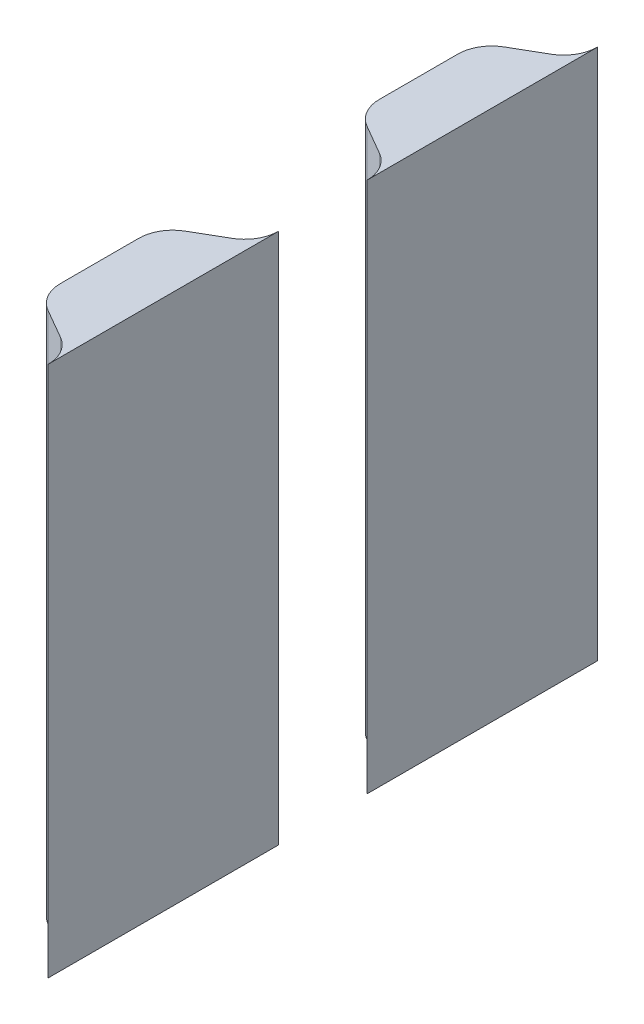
from build123d import *

# Parameters (mm, degrees)
EXTRUSION1_DEPTH   = 25
EXTRUSION1_2_DEPTH = 25


with BuildPart() as part:
    # Esquisse1 → Extrusion1 (new body)
    with BuildSketch(Plane(origin=(0, 0, 0), x_dir=(1, 0, 0), z_dir=(0, 1, 0))):
        with BuildLine():
            ThreePointArc((57, 9.339621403), (57.213737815, 10.1385439), (57.797846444, 10.72401646))
            Line((57.797846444, 10.72401646), (59.202153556, 11.537707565))
            ThreePointArc((59.202153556, 11.537707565), (59.786262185, 12.123180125), (60, 12.922102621))
            Line((60, 12.922102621), (60, 2.076239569))
            ThreePointArc((60, 2.076239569), (59.785640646, 2.876239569), (59.2, 3.461880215))
            Line((59.2, 3.461880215), (57.8, 4.270170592))
            ThreePointArc((57.8, 4.270170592), (57.214359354, 4.855811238), (57, 5.655811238))
            Line((57, 5.655811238), (57, 9.339621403))
        make_face()
    extrude(amount=EXTRUSION1_DEPTH)


with BuildPart() as body_2:
    # Esquisse1 → Extrusion1 2 (new body)
    with BuildSketch(Plane(origin=(0, 0, 0), x_dir=(1, 0, 0), z_dir=(0, 1, 0))):
        with BuildLine():
            Line((57.797846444, 19.27598354), (59.202153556, 18.462292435))
            ThreePointArc((59.202153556, 18.462292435), (59.786262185, 17.876819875), (60, 17.077897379))
            Line((60, 17.077897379), (60, 27.923760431))
            ThreePointArc((60, 27.923760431), (59.785640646, 27.123760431), (59.2, 26.538119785))
            Line((59.2, 26.538119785), (57.8, 25.729829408))
            ThreePointArc((57.8, 25.729829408), (57.214359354, 25.144188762), (57, 24.344188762))
            Line((57, 24.344188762), (57, 20.660378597))
            ThreePointArc((57, 20.660378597), (57.213737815, 19.8614561), (57.797846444, 19.27598354))
        make_face()
    extrude(amount=EXTRUSION1_2_DEPTH)


solid = Compound([part.part, body_2.part])
